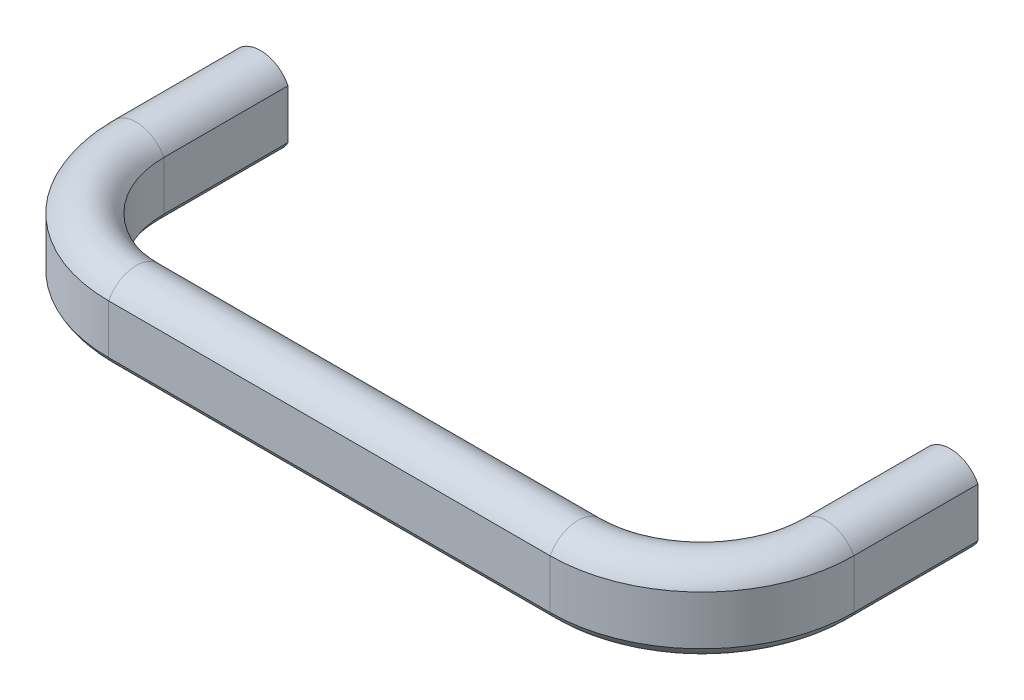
ISO-10303-21;
HEADER;
FILE_DESCRIPTION(('STEP AP214'),'2;1');
FILE_NAME('part.step','',(''),(''),'','','');
FILE_SCHEMA(('AUTOMOTIVE_DESIGN { 1 0 10303 214 1 1 1 1 }'));
ENDSEC;
DATA;
#1=APPLICATION_CONTEXT('core data for automotive mechanical design processes');
#2=APPLICATION_PROTOCOL_DEFINITION('international standard','automotive_design',2000,#1);
#3=PRODUCT_CONTEXT('',#1,'mechanical');
#4=PRODUCT('Part','Part','',(#3));
#5=PRODUCT_RELATED_PRODUCT_CATEGORY('part','',(#4));
#6=PRODUCT_DEFINITION_FORMATION('','',#4);
#7=PRODUCT_DEFINITION_CONTEXT('part definition',#1,'design');
#8=PRODUCT_DEFINITION('design','',#6,#7);
#9=PRODUCT_DEFINITION_SHAPE('','',#8);
#10=(LENGTH_UNIT() NAMED_UNIT(*) SI_UNIT(.MILLI.,.METRE.));
#11=(NAMED_UNIT(*) PLANE_ANGLE_UNIT() SI_UNIT($,.RADIAN.));
#12=(NAMED_UNIT(*) SI_UNIT($,.STERADIAN.) SOLID_ANGLE_UNIT());
#13=UNCERTAINTY_MEASURE_WITH_UNIT(LENGTH_MEASURE(1.E-05),#10,'distance_accuracy_value','');
#14=(GEOMETRIC_REPRESENTATION_CONTEXT(3) GLOBAL_UNCERTAINTY_ASSIGNED_CONTEXT((#13)) GLOBAL_UNIT_ASSIGNED_CONTEXT((#10,
#11,#12)) REPRESENTATION_CONTEXT('',''));
#15=CARTESIAN_POINT('',(0.,0.,0.));
#16=DIRECTION('',(0.,0.,1.));
#17=DIRECTION('',(1.,0.,0.));
#18=AXIS2_PLACEMENT_3D('',#15,#16,#17);
#19=CARTESIAN_POINT('',(0.,-1.5,0.));
#20=DIRECTION('',(0.,0.,1.));
#21=DIRECTION('',(0.,-1.,0.));
#22=AXIS2_PLACEMENT_3D('',#19,#20,#21);
#23=PLANE('',#22);
#24=CARTESIAN_POINT('',(0.,0.,0.));
#25=DIRECTION('',(0.,0.,1.));
#26=DIRECTION('',(1.,0.,0.));
#27=AXIS2_PLACEMENT_3D('',#24,#25,#26);
#28=CIRCLE('',#27,2.95);
#29=CARTESIAN_POINT('',(2.95,0.,0.));
#30=VERTEX_POINT('',#29);
#31=EDGE_CURVE('E9',#30,#30,#28,.T.);
#32=ORIENTED_EDGE('',*,*,#31,.T.);
#33=EDGE_LOOP('',(#32));
#34=FACE_BOUND('',#33,.T.);
#35=CARTESIAN_POINT('',(0.,-1.5,0.));
#36=DIRECTION('',(0.,0.,1.));
#37=DIRECTION('',(0.,-1.,0.));
#38=AXIS2_PLACEMENT_3D('',#35,#36,#37);
#39=CIRCLE('',#38,4.5);
#40=CARTESIAN_POINT('',(-4.,-3.56155281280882,0.));
#41=VERTEX_POINT('',#40);
#42=CARTESIAN_POINT('',(4.,-3.56155281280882,0.));
#43=VERTEX_POINT('',#42);
#44=EDGE_CURVE('E212',#41,#43,#39,.T.);
#45=ORIENTED_EDGE('',*,*,#44,.F.);
#46=DIRECTION('',(0.,1.,0.));
#47=VECTOR('',#46,1.);
#48=CARTESIAN_POINT('',(-4.,-3.56155281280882,0.));
#49=LINE('',#48,#47);
#50=CARTESIAN_POINT('',(-4.,3.56155281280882,0.));
#51=VERTEX_POINT('',#50);
#52=EDGE_CURVE('E29',#41,#51,#49,.T.);
#53=ORIENTED_EDGE('',*,*,#52,.T.);
#54=CARTESIAN_POINT('',(0.,1.5,0.));
#55=DIRECTION('',(0.,0.,-1.));
#56=DIRECTION('',(0.,1.,0.));
#57=AXIS2_PLACEMENT_3D('',#54,#55,#56);
#58=CIRCLE('',#57,4.5);
#59=CARTESIAN_POINT('',(4.,3.56155281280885,0.));
#60=VERTEX_POINT('',#59);
#61=EDGE_CURVE('E37',#51,#60,#58,.T.);
#62=ORIENTED_EDGE('',*,*,#61,.T.);
#63=DIRECTION('',(0.,1.,0.));
#64=VECTOR('',#63,1.);
#65=CARTESIAN_POINT('',(4.,-3.56155281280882,0.));
#66=LINE('',#65,#64);
#67=EDGE_CURVE('E235',#43,#60,#66,.T.);
#68=ORIENTED_EDGE('',*,*,#67,.F.);
#69=EDGE_LOOP('',(#45,#53,#62,#68));
#70=FACE_BOUND('',#69,.T.);
#71=ADVANCED_FACE('F14',(#34,#70),#23,.F.);
#72=CARTESIAN_POINT('',(100.,-1.5,0.));
#73=DIRECTION('',(0.,0.,-1.));
#74=DIRECTION('',(0.,-1.,0.));
#75=AXIS2_PLACEMENT_3D('',#72,#73,#74);
#76=PLANE('',#75);
#77=CARTESIAN_POINT('',(100.,0.,0.));
#78=DIRECTION('',(0.,0.,-1.));
#79=DIRECTION('',(-1.,0.,0.));
#80=AXIS2_PLACEMENT_3D('',#77,#78,#79);
#81=CIRCLE('',#80,2.95000000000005);
#82=CARTESIAN_POINT('',(97.05,0.,0.));
#83=VERTEX_POINT('',#82);
#84=EDGE_CURVE('E233',#83,#83,#81,.F.);
#85=ORIENTED_EDGE('',*,*,#84,.T.);
#86=EDGE_LOOP('',(#85));
#87=FACE_BOUND('',#86,.T.);
#88=CARTESIAN_POINT('',(100.,-1.5,0.));
#89=DIRECTION('',(0.,0.,-1.));
#90=DIRECTION('',(0.,-1.,0.));
#91=AXIS2_PLACEMENT_3D('',#88,#89,#90);
#92=CIRCLE('',#91,4.5);
#93=CARTESIAN_POINT('',(104.,-3.56155281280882,0.));
#94=VERTEX_POINT('',#93);
#95=CARTESIAN_POINT('',(96.,-3.56155281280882,0.));
#96=VERTEX_POINT('',#95);
#97=EDGE_CURVE('E109',#94,#96,#92,.T.);
#98=ORIENTED_EDGE('',*,*,#97,.T.);
#99=DIRECTION('',(0.,1.,0.));
#100=VECTOR('',#99,1.);
#101=CARTESIAN_POINT('',(96.,-3.56155281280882,0.));
#102=LINE('',#101,#100);
#103=CARTESIAN_POINT('',(96.,3.56155281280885,0.));
#104=VERTEX_POINT('',#103);
#105=EDGE_CURVE('E123',#96,#104,#102,.T.);
#106=ORIENTED_EDGE('',*,*,#105,.T.);
#107=CARTESIAN_POINT('',(100.,1.5,0.));
#108=DIRECTION('',(0.,0.,1.));
#109=DIRECTION('',(0.,1.,0.));
#110=AXIS2_PLACEMENT_3D('',#107,#108,#109);
#111=CIRCLE('',#110,4.5);
#112=CARTESIAN_POINT('',(104.,3.56155281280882,0.));
#113=VERTEX_POINT('',#112);
#114=EDGE_CURVE('E131',#113,#104,#111,.T.);
#115=ORIENTED_EDGE('',*,*,#114,.F.);
#116=DIRECTION('',(0.,1.,0.));
#117=VECTOR('',#116,1.);
#118=CARTESIAN_POINT('',(104.,-3.56155281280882,0.));
#119=LINE('',#118,#117);
#120=EDGE_CURVE('E126',#94,#113,#119,.T.);
#121=ORIENTED_EDGE('',*,*,#120,.F.);
#122=EDGE_LOOP('',(#98,#106,#115,#121));
#123=FACE_BOUND('',#122,.T.);
#124=ADVANCED_FACE('F121',(#87,#123),#76,.T.);
#125=CARTESIAN_POINT('',(-4.,-3.56155281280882,18.));
#126=DIRECTION('',(-1.,0.,0.));
#127=DIRECTION('',(0.,0.,1.));
#128=AXIS2_PLACEMENT_3D('',#125,#126,#127);
#129=PLANE('',#128);
#130=DIRECTION('',(0.,1.,0.));
#131=VECTOR('',#130,1.);
#132=CARTESIAN_POINT('',(-4.,-3.56155281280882,18.));
#133=LINE('',#132,#131);
#134=CARTESIAN_POINT('',(-4.,-3.56155281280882,18.));
#135=VERTEX_POINT('',#134);
#136=CARTESIAN_POINT('',(-4.,3.56155281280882,18.));
#137=VERTEX_POINT('',#136);
#138=EDGE_CURVE('E203',#135,#137,#133,.T.);
#139=ORIENTED_EDGE('',*,*,#138,.T.);
#140=DIRECTION('',(0.,0.,-1.));
#141=VECTOR('',#140,1.);
#142=CARTESIAN_POINT('',(-4.,3.56155281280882,18.));
#143=LINE('',#142,#141);
#144=EDGE_CURVE('E228',#137,#51,#143,.T.);
#145=ORIENTED_EDGE('',*,*,#144,.T.);
#146=ORIENTED_EDGE('',*,*,#52,.F.);
#147=DIRECTION('',(0.,0.,-1.));
#148=VECTOR('',#147,1.);
#149=CARTESIAN_POINT('',(-4.,-3.56155281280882,18.));
#150=LINE('',#149,#148);
#151=EDGE_CURVE('E230',#135,#41,#150,.T.);
#152=ORIENTED_EDGE('',*,*,#151,.F.);
#153=EDGE_LOOP('',(#139,#145,#146,#152));
#154=FACE_BOUND('',#153,.T.);
#155=ADVANCED_FACE('F266',(#154),#129,.T.);
#156=CARTESIAN_POINT('',(0.,1.5,18.));
#157=DIRECTION('',(0.,0.,-1.));
#158=DIRECTION('',(-1.,0.,0.));
#159=AXIS2_PLACEMENT_3D('',#156,#157,#158);
#160=CYLINDRICAL_SURFACE('',#159,4.5);
#161=CARTESIAN_POINT('',(0.,1.5,18.));
#162=DIRECTION('',(0.,0.,-1.));
#163=DIRECTION('',(0.,1.,0.));
#164=AXIS2_PLACEMENT_3D('',#161,#162,#163);
#165=CIRCLE('',#164,4.5);
#166=CARTESIAN_POINT('',(4.,3.56155281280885,18.));
#167=VERTEX_POINT('',#166);
#168=EDGE_CURVE('E218',#137,#167,#165,.T.);
#169=ORIENTED_EDGE('',*,*,#168,.T.);
#170=DIRECTION('',(0.,0.,-1.));
#171=VECTOR('',#170,1.);
#172=CARTESIAN_POINT('',(4.,3.56155281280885,18.));
#173=LINE('',#172,#171);
#174=EDGE_CURVE('E226',#167,#60,#173,.T.);
#175=ORIENTED_EDGE('',*,*,#174,.T.);
#176=ORIENTED_EDGE('',*,*,#61,.F.);
#177=ORIENTED_EDGE('',*,*,#144,.F.);
#178=EDGE_LOOP('',(#169,#175,#176,#177));
#179=FACE_BOUND('',#178,.T.);
#180=ADVANCED_FACE('F340',(#179),#160,.T.);
#181=CARTESIAN_POINT('',(4.,-3.56155281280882,18.));
#182=DIRECTION('',(-1.,0.,0.));
#183=DIRECTION('',(0.,-1.,0.));
#184=AXIS2_PLACEMENT_3D('',#181,#182,#183);
#185=PLANE('',#184);
#186=DIRECTION('',(0.,1.,0.));
#187=VECTOR('',#186,1.);
#188=CARTESIAN_POINT('',(4.,-3.56155281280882,18.));
#189=LINE('',#188,#187);
#190=CARTESIAN_POINT('',(4.,-3.56155281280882,18.));
#191=VERTEX_POINT('',#190);
#192=EDGE_CURVE('E215',#191,#167,#189,.T.);
#193=ORIENTED_EDGE('',*,*,#192,.F.);
#194=DIRECTION('',(0.,0.,-1.));
#195=VECTOR('',#194,1.);
#196=CARTESIAN_POINT('',(4.,-3.56155281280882,18.));
#197=LINE('',#196,#195);
#198=EDGE_CURVE('E223',#191,#43,#197,.T.);
#199=ORIENTED_EDGE('',*,*,#198,.T.);
#200=ORIENTED_EDGE('',*,*,#67,.T.);
#201=ORIENTED_EDGE('',*,*,#174,.F.);
#202=EDGE_LOOP('',(#193,#199,#200,#201));
#203=FACE_BOUND('',#202,.T.);
#204=ADVANCED_FACE('F336',(#203),#185,.F.);
#205=CARTESIAN_POINT('',(0.,-1.5,18.));
#206=DIRECTION('',(0.,0.,-1.));
#207=DIRECTION('',(-1.,0.,0.));
#208=AXIS2_PLACEMENT_3D('',#205,#206,#207);
#209=CYLINDRICAL_SURFACE('',#208,4.5);
#210=CARTESIAN_POINT('',(0.,-1.5,18.));
#211=DIRECTION('',(0.,0.,1.));
#212=DIRECTION('',(0.,-1.,0.));
#213=AXIS2_PLACEMENT_3D('',#210,#211,#212);
#214=CIRCLE('',#213,4.5);
#215=EDGE_CURVE('E188',#135,#191,#214,.T.);
#216=ORIENTED_EDGE('',*,*,#215,.F.);
#217=ORIENTED_EDGE('',*,*,#151,.T.);
#218=ORIENTED_EDGE('',*,*,#44,.T.);
#219=ORIENTED_EDGE('',*,*,#198,.F.);
#220=EDGE_LOOP('',(#216,#217,#218,#219));
#221=FACE_BOUND('',#220,.T.);
#222=ADVANCED_FACE('F332',(#221),#209,.T.);
#223=CARTESIAN_POINT('',(18.,0.,18.));
#224=DIRECTION('',(0.,-1.,0.));
#225=DIRECTION('',(1.,0.,0.));
#226=AXIS2_PLACEMENT_3D('',#223,#224,#225);
#227=CYLINDRICAL_SURFACE('',#226,22.);
#228=DIRECTION('',(0.,1.,0.));
#229=VECTOR('',#228,1.);
#230=CARTESIAN_POINT('',(18.,-3.56155281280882,40.));
#231=LINE('',#230,#229);
#232=CARTESIAN_POINT('',(18.,-3.56155281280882,40.));
#233=VERTEX_POINT('',#232);
#234=CARTESIAN_POINT('',(18.,3.56155281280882,40.));
#235=VERTEX_POINT('',#234);
#236=EDGE_CURVE('E179',#233,#235,#231,.T.);
#237=ORIENTED_EDGE('',*,*,#236,.T.);
#238=CARTESIAN_POINT('',(18.,3.56155281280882,18.));
#239=DIRECTION('',(0.,-1.,0.));
#240=DIRECTION('',(1.,0.,0.));
#241=AXIS2_PLACEMENT_3D('',#238,#239,#240);
#242=CIRCLE('',#241,22.);
#243=EDGE_CURVE('E206',#235,#137,#242,.T.);
#244=ORIENTED_EDGE('',*,*,#243,.T.);
#245=ORIENTED_EDGE('',*,*,#138,.F.);
#246=CARTESIAN_POINT('',(18.,-3.56155281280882,18.));
#247=DIRECTION('',(0.,-1.,0.));
#248=DIRECTION('',(1.,0.,0.));
#249=AXIS2_PLACEMENT_3D('',#246,#247,#248);
#250=CIRCLE('',#249,22.);
#251=EDGE_CURVE('E209',#233,#135,#250,.T.);
#252=ORIENTED_EDGE('',*,*,#251,.F.);
#253=EDGE_LOOP('',(#237,#244,#245,#252));
#254=FACE_BOUND('',#253,.T.);
#255=ADVANCED_FACE('F328',(#254),#227,.T.);
#256=CARTESIAN_POINT('',(18.,1.5,18.));
#257=DIRECTION('',(0.,-1.,0.));
#258=DIRECTION('',(1.,0.,0.));
#259=AXIS2_PLACEMENT_3D('',#256,#257,#258);
#260=TOROIDAL_SURFACE('',#259,18.,4.5);
#261=CARTESIAN_POINT('',(18.,1.5,36.));
#262=DIRECTION('',(-1.,0.,0.));
#263=DIRECTION('',(0.,1.,0.));
#264=AXIS2_PLACEMENT_3D('',#261,#262,#263);
#265=CIRCLE('',#264,4.5);
#266=CARTESIAN_POINT('',(18.,3.56155281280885,32.));
#267=VERTEX_POINT('',#266);
#268=EDGE_CURVE('E194',#235,#267,#265,.T.);
#269=ORIENTED_EDGE('',*,*,#268,.T.);
#270=CARTESIAN_POINT('',(18.,3.56155281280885,18.));
#271=DIRECTION('',(0.,-1.,0.));
#272=DIRECTION('',(1.,0.,0.));
#273=AXIS2_PLACEMENT_3D('',#270,#271,#272);
#274=CIRCLE('',#273,14.);
#275=EDGE_CURVE('E202',#267,#167,#274,.T.);
#276=ORIENTED_EDGE('',*,*,#275,.T.);
#277=ORIENTED_EDGE('',*,*,#168,.F.);
#278=ORIENTED_EDGE('',*,*,#243,.F.);
#279=EDGE_LOOP('',(#269,#276,#277,#278));
#280=FACE_BOUND('',#279,.T.);
#281=ADVANCED_FACE('F324',(#280),#260,.T.);
#282=CARTESIAN_POINT('',(18.,0.,18.));
#283=DIRECTION('',(0.,-1.,0.));
#284=DIRECTION('',(1.,0.,0.));
#285=AXIS2_PLACEMENT_3D('',#282,#283,#284);
#286=CYLINDRICAL_SURFACE('',#285,14.);
#287=DIRECTION('',(0.,1.,0.));
#288=VECTOR('',#287,1.);
#289=CARTESIAN_POINT('',(18.,-3.56155281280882,32.));
#290=LINE('',#289,#288);
#291=CARTESIAN_POINT('',(18.,-3.56155281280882,32.));
#292=VERTEX_POINT('',#291);
#293=EDGE_CURVE('E191',#292,#267,#290,.T.);
#294=ORIENTED_EDGE('',*,*,#293,.F.);
#295=CARTESIAN_POINT('',(18.,-3.56155281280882,18.));
#296=DIRECTION('',(0.,-1.,0.));
#297=DIRECTION('',(1.,0.,0.));
#298=AXIS2_PLACEMENT_3D('',#295,#296,#297);
#299=CIRCLE('',#298,14.);
#300=EDGE_CURVE('E199',#292,#191,#299,.T.);
#301=ORIENTED_EDGE('',*,*,#300,.T.);
#302=ORIENTED_EDGE('',*,*,#192,.T.);
#303=ORIENTED_EDGE('',*,*,#275,.F.);
#304=EDGE_LOOP('',(#294,#301,#302,#303));
#305=FACE_BOUND('',#304,.T.);
#306=ADVANCED_FACE('F320',(#305),#286,.F.);
#307=CARTESIAN_POINT('',(18.,-1.5,18.));
#308=DIRECTION('',(0.,-1.,0.));
#309=DIRECTION('',(1.,0.,0.));
#310=AXIS2_PLACEMENT_3D('',#307,#308,#309);
#311=TOROIDAL_SURFACE('',#310,18.,4.5);
#312=CARTESIAN_POINT('',(18.,-1.5,36.));
#313=DIRECTION('',(1.,0.,0.));
#314=DIRECTION('',(0.,-1.,0.));
#315=AXIS2_PLACEMENT_3D('',#312,#313,#314);
#316=CIRCLE('',#315,4.5);
#317=EDGE_CURVE('E164',#233,#292,#316,.T.);
#318=ORIENTED_EDGE('',*,*,#317,.F.);
#319=ORIENTED_EDGE('',*,*,#251,.T.);
#320=ORIENTED_EDGE('',*,*,#215,.T.);
#321=ORIENTED_EDGE('',*,*,#300,.F.);
#322=EDGE_LOOP('',(#318,#319,#320,#321));
#323=FACE_BOUND('',#322,.T.);
#324=ADVANCED_FACE('F316',(#323),#311,.T.);
#325=CARTESIAN_POINT('',(82.,-3.56155281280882,40.));
#326=DIRECTION('',(0.,0.,1.));
#327=DIRECTION('',(1.,0.,0.));
#328=AXIS2_PLACEMENT_3D('',#325,#326,#327);
#329=PLANE('',#328);
#330=DIRECTION('',(0.,1.,0.));
#331=VECTOR('',#330,1.);
#332=CARTESIAN_POINT('',(82.,-3.56155281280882,40.));
#333=LINE('',#332,#331);
#334=CARTESIAN_POINT('',(82.,-3.56155281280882,40.));
#335=VERTEX_POINT('',#334);
#336=CARTESIAN_POINT('',(82.,3.56155281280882,40.));
#337=VERTEX_POINT('',#336);
#338=EDGE_CURVE('E155',#335,#337,#333,.T.);
#339=ORIENTED_EDGE('',*,*,#338,.T.);
#340=DIRECTION('',(-1.,0.,0.));
#341=VECTOR('',#340,1.);
#342=CARTESIAN_POINT('',(82.,3.56155281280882,40.));
#343=LINE('',#342,#341);
#344=EDGE_CURVE('E182',#337,#235,#343,.T.);
#345=ORIENTED_EDGE('',*,*,#344,.T.);
#346=ORIENTED_EDGE('',*,*,#236,.F.);
#347=DIRECTION('',(-1.,0.,0.));
#348=VECTOR('',#347,1.);
#349=CARTESIAN_POINT('',(82.,-3.56155281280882,40.));
#350=LINE('',#349,#348);
#351=EDGE_CURVE('E185',#335,#233,#350,.T.);
#352=ORIENTED_EDGE('',*,*,#351,.F.);
#353=EDGE_LOOP('',(#339,#345,#346,#352));
#354=FACE_BOUND('',#353,.T.);
#355=ADVANCED_FACE('F312',(#354),#329,.T.);
#356=CARTESIAN_POINT('',(82.,1.5,36.));
#357=DIRECTION('',(-1.,0.,0.));
#358=DIRECTION('',(0.,0.,1.));
#359=AXIS2_PLACEMENT_3D('',#356,#357,#358);
#360=CYLINDRICAL_SURFACE('',#359,4.5);
#361=CARTESIAN_POINT('',(82.,1.5,36.));
#362=DIRECTION('',(-1.,0.,0.));
#363=DIRECTION('',(0.,1.,0.));
#364=AXIS2_PLACEMENT_3D('',#361,#362,#363);
#365=CIRCLE('',#364,4.5);
#366=CARTESIAN_POINT('',(82.,3.56155281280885,32.));
#367=VERTEX_POINT('',#366);
#368=EDGE_CURVE('E170',#337,#367,#365,.T.);
#369=ORIENTED_EDGE('',*,*,#368,.T.);
#370=DIRECTION('',(-1.,0.,0.));
#371=VECTOR('',#370,1.);
#372=CARTESIAN_POINT('',(82.,3.56155281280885,32.));
#373=LINE('',#372,#371);
#374=EDGE_CURVE('E178',#367,#267,#373,.T.);
#375=ORIENTED_EDGE('',*,*,#374,.T.);
#376=ORIENTED_EDGE('',*,*,#268,.F.);
#377=ORIENTED_EDGE('',*,*,#344,.F.);
#378=EDGE_LOOP('',(#369,#375,#376,#377));
#379=FACE_BOUND('',#378,.T.);
#380=ADVANCED_FACE('F308',(#379),#360,.T.);
#381=CARTESIAN_POINT('',(82.,-3.56155281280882,32.));
#382=DIRECTION('',(0.,0.,1.));
#383=DIRECTION('',(0.,1.,0.));
#384=AXIS2_PLACEMENT_3D('',#381,#382,#383);
#385=PLANE('',#384);
#386=DIRECTION('',(0.,1.,0.));
#387=VECTOR('',#386,1.);
#388=CARTESIAN_POINT('',(82.,-3.56155281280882,32.));
#389=LINE('',#388,#387);
#390=CARTESIAN_POINT('',(82.,-3.56155281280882,32.));
#391=VERTEX_POINT('',#390);
#392=EDGE_CURVE('E167',#391,#367,#389,.T.);
#393=ORIENTED_EDGE('',*,*,#392,.F.);
#394=DIRECTION('',(-1.,0.,0.));
#395=VECTOR('',#394,1.);
#396=CARTESIAN_POINT('',(82.,-3.56155281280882,32.));
#397=LINE('',#396,#395);
#398=EDGE_CURVE('E175',#391,#292,#397,.T.);
#399=ORIENTED_EDGE('',*,*,#398,.T.);
#400=ORIENTED_EDGE('',*,*,#293,.T.);
#401=ORIENTED_EDGE('',*,*,#374,.F.);
#402=EDGE_LOOP('',(#393,#399,#400,#401));
#403=FACE_BOUND('',#402,.T.);
#404=ADVANCED_FACE('F304',(#403),#385,.F.);
#405=CARTESIAN_POINT('',(82.,-1.5,36.));
#406=DIRECTION('',(-1.,0.,0.));
#407=DIRECTION('',(0.,0.,1.));
#408=AXIS2_PLACEMENT_3D('',#405,#406,#407);
#409=CYLINDRICAL_SURFACE('',#408,4.5);
#410=CARTESIAN_POINT('',(82.,-1.5,36.));
#411=DIRECTION('',(1.,0.,0.));
#412=DIRECTION('',(0.,-1.,0.));
#413=AXIS2_PLACEMENT_3D('',#410,#411,#412);
#414=CIRCLE('',#413,4.5);
#415=EDGE_CURVE('E150',#335,#391,#414,.T.);
#416=ORIENTED_EDGE('',*,*,#415,.F.);
#417=ORIENTED_EDGE('',*,*,#351,.T.);
#418=ORIENTED_EDGE('',*,*,#317,.T.);
#419=ORIENTED_EDGE('',*,*,#398,.F.);
#420=EDGE_LOOP('',(#416,#417,#418,#419));
#421=FACE_BOUND('',#420,.T.);
#422=ADVANCED_FACE('F300',(#421),#409,.T.);
#423=CARTESIAN_POINT('',(82.,0.,18.));
#424=DIRECTION('',(0.,-1.,0.));
#425=DIRECTION('',(1.,0.,0.));
#426=AXIS2_PLACEMENT_3D('',#423,#424,#425);
#427=CYLINDRICAL_SURFACE('',#426,22.);
#428=DIRECTION('',(0.,1.,0.));
#429=VECTOR('',#428,1.);
#430=CARTESIAN_POINT('',(104.,-3.56155281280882,18.));
#431=LINE('',#430,#429);
#432=CARTESIAN_POINT('',(104.,-3.56155281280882,18.));
#433=VERTEX_POINT('',#432);
#434=CARTESIAN_POINT('',(104.,3.56155281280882,18.));
#435=VERTEX_POINT('',#434);
#436=EDGE_CURVE('E117',#433,#435,#431,.T.);
#437=ORIENTED_EDGE('',*,*,#436,.T.);
#438=CARTESIAN_POINT('',(82.,3.56155281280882,18.));
#439=DIRECTION('',(0.,-1.,0.));
#440=DIRECTION('',(1.,0.,0.));
#441=AXIS2_PLACEMENT_3D('',#438,#439,#440);
#442=CIRCLE('',#441,22.);
#443=EDGE_CURVE('E158',#435,#337,#442,.T.);
#444=ORIENTED_EDGE('',*,*,#443,.T.);
#445=ORIENTED_EDGE('',*,*,#338,.F.);
#446=CARTESIAN_POINT('',(82.,-3.56155281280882,18.));
#447=DIRECTION('',(0.,-1.,0.));
#448=DIRECTION('',(1.,0.,0.));
#449=AXIS2_PLACEMENT_3D('',#446,#447,#448);
#450=CIRCLE('',#449,22.);
#451=EDGE_CURVE('E161',#433,#335,#450,.T.);
#452=ORIENTED_EDGE('',*,*,#451,.F.);
#453=EDGE_LOOP('',(#437,#444,#445,#452));
#454=FACE_BOUND('',#453,.T.);
#455=ADVANCED_FACE('F296',(#454),#427,.T.);
#456=CARTESIAN_POINT('',(82.,1.5,18.));
#457=DIRECTION('',(0.,-1.,0.));
#458=DIRECTION('',(1.,0.,0.));
#459=AXIS2_PLACEMENT_3D('',#456,#457,#458);
#460=TOROIDAL_SURFACE('',#459,18.,4.5);
#461=CARTESIAN_POINT('',(100.,1.5,18.));
#462=DIRECTION('',(0.,0.,1.));
#463=DIRECTION('',(0.,1.,0.));
#464=AXIS2_PLACEMENT_3D('',#461,#462,#463);
#465=CIRCLE('',#464,4.5);
#466=CARTESIAN_POINT('',(96.,3.56155281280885,18.));
#467=VERTEX_POINT('',#466);
#468=EDGE_CURVE('E140',#435,#467,#465,.T.);
#469=ORIENTED_EDGE('',*,*,#468,.T.);
#470=CARTESIAN_POINT('',(82.,3.56155281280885,18.));
#471=DIRECTION('',(0.,-1.,0.));
#472=DIRECTION('',(1.,0.,0.));
#473=AXIS2_PLACEMENT_3D('',#470,#471,#472);
#474=CIRCLE('',#473,14.);
#475=EDGE_CURVE('E154',#467,#367,#474,.T.);
#476=ORIENTED_EDGE('',*,*,#475,.T.);
#477=ORIENTED_EDGE('',*,*,#368,.F.);
#478=ORIENTED_EDGE('',*,*,#443,.F.);
#479=EDGE_LOOP('',(#469,#476,#477,#478));
#480=FACE_BOUND('',#479,.T.);
#481=ADVANCED_FACE('F292',(#480),#460,.T.);
#482=CARTESIAN_POINT('',(82.,0.,18.));
#483=DIRECTION('',(0.,-1.,0.));
#484=DIRECTION('',(1.,0.,0.));
#485=AXIS2_PLACEMENT_3D('',#482,#483,#484);
#486=CYLINDRICAL_SURFACE('',#485,14.);
#487=DIRECTION('',(0.,1.,0.));
#488=VECTOR('',#487,1.);
#489=CARTESIAN_POINT('',(96.,-3.56155281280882,18.));
#490=LINE('',#489,#488);
#491=CARTESIAN_POINT('',(96.,-3.56155281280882,18.));
#492=VERTEX_POINT('',#491);
#493=EDGE_CURVE('E138',#492,#467,#490,.T.);
#494=ORIENTED_EDGE('',*,*,#493,.F.);
#495=CARTESIAN_POINT('',(82.,-3.56155281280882,18.));
#496=DIRECTION('',(0.,-1.,0.));
#497=DIRECTION('',(1.,0.,0.));
#498=AXIS2_PLACEMENT_3D('',#495,#496,#497);
#499=CIRCLE('',#498,14.);
#500=EDGE_CURVE('E151',#492,#391,#499,.T.);
#501=ORIENTED_EDGE('',*,*,#500,.T.);
#502=ORIENTED_EDGE('',*,*,#392,.T.);
#503=ORIENTED_EDGE('',*,*,#475,.F.);
#504=EDGE_LOOP('',(#494,#501,#502,#503));
#505=FACE_BOUND('',#504,.T.);
#506=ADVANCED_FACE('F288',(#505),#486,.F.);
#507=CARTESIAN_POINT('',(82.,-1.5,18.));
#508=DIRECTION('',(0.,-1.,0.));
#509=DIRECTION('',(1.,0.,0.));
#510=AXIS2_PLACEMENT_3D('',#507,#508,#509);
#511=TOROIDAL_SURFACE('',#510,18.,4.5);
#512=CARTESIAN_POINT('',(100.,-1.5,18.));
#513=DIRECTION('',(0.,0.,-1.));
#514=DIRECTION('',(0.,-1.,0.));
#515=AXIS2_PLACEMENT_3D('',#512,#513,#514);
#516=CIRCLE('',#515,4.5);
#517=EDGE_CURVE('E112',#433,#492,#516,.T.);
#518=ORIENTED_EDGE('',*,*,#517,.F.);
#519=ORIENTED_EDGE('',*,*,#451,.T.);
#520=ORIENTED_EDGE('',*,*,#415,.T.);
#521=ORIENTED_EDGE('',*,*,#500,.F.);
#522=EDGE_LOOP('',(#518,#519,#520,#521));
#523=FACE_BOUND('',#522,.T.);
#524=ADVANCED_FACE('F275',(#523),#511,.T.);
#525=CARTESIAN_POINT('',(100.,-1.5,18.));
#526=DIRECTION('',(0.,0.,-1.));
#527=DIRECTION('',(0.,-1.,0.));
#528=AXIS2_PLACEMENT_3D('',#525,#526,#527);
#529=CYLINDRICAL_SURFACE('',#528,4.5);
#530=DIRECTION('',(0.,0.,-1.));
#531=VECTOR('',#530,1.);
#532=CARTESIAN_POINT('',(104.,-3.56155281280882,18.));
#533=LINE('',#532,#531);
#534=EDGE_CURVE('E148',#433,#94,#533,.T.);
#535=ORIENTED_EDGE('',*,*,#534,.F.);
#536=ORIENTED_EDGE('',*,*,#517,.T.);
#537=DIRECTION('',(0.,0.,-1.));
#538=VECTOR('',#537,1.);
#539=CARTESIAN_POINT('',(96.,-3.56155281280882,18.));
#540=LINE('',#539,#538);
#541=EDGE_CURVE('E105',#492,#96,#540,.T.);
#542=ORIENTED_EDGE('',*,*,#541,.T.);
#543=ORIENTED_EDGE('',*,*,#97,.F.);
#544=EDGE_LOOP('',(#535,#536,#542,#543));
#545=FACE_BOUND('',#544,.T.);
#546=ADVANCED_FACE('F108',(#545),#529,.T.);
#547=CARTESIAN_POINT('',(104.,-3.56155281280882,18.));
#548=DIRECTION('',(-1.,0.,0.));
#549=DIRECTION('',(0.,-1.,0.));
#550=AXIS2_PLACEMENT_3D('',#547,#548,#549);
#551=PLANE('',#550);
#552=DIRECTION('',(0.,0.,-1.));
#553=VECTOR('',#552,1.);
#554=CARTESIAN_POINT('',(104.,3.56155281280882,18.));
#555=LINE('',#554,#553);
#556=EDGE_CURVE('E146',#435,#113,#555,.T.);
#557=ORIENTED_EDGE('',*,*,#556,.F.);
#558=ORIENTED_EDGE('',*,*,#436,.F.);
#559=ORIENTED_EDGE('',*,*,#534,.T.);
#560=ORIENTED_EDGE('',*,*,#120,.T.);
#561=EDGE_LOOP('',(#557,#558,#559,#560));
#562=FACE_BOUND('',#561,.T.);
#563=ADVANCED_FACE('F274',(#562),#551,.F.);
#564=CARTESIAN_POINT('',(100.,1.5,18.));
#565=DIRECTION('',(0.,0.,-1.));
#566=DIRECTION('',(0.,-1.,0.));
#567=AXIS2_PLACEMENT_3D('',#564,#565,#566);
#568=CYLINDRICAL_SURFACE('',#567,4.5);
#569=DIRECTION('',(0.,0.,-1.));
#570=VECTOR('',#569,1.);
#571=CARTESIAN_POINT('',(96.,3.56155281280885,18.));
#572=LINE('',#571,#570);
#573=EDGE_CURVE('E116',#467,#104,#572,.T.);
#574=ORIENTED_EDGE('',*,*,#573,.F.);
#575=ORIENTED_EDGE('',*,*,#468,.F.);
#576=ORIENTED_EDGE('',*,*,#556,.T.);
#577=ORIENTED_EDGE('',*,*,#114,.T.);
#578=EDGE_LOOP('',(#574,#575,#576,#577));
#579=FACE_BOUND('',#578,.T.);
#580=ADVANCED_FACE('F279',(#579),#568,.T.);
#581=CARTESIAN_POINT('',(96.,-3.56155281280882,18.));
#582=DIRECTION('',(-1.,0.,0.));
#583=DIRECTION('',(0.,-1.,0.));
#584=AXIS2_PLACEMENT_3D('',#581,#582,#583);
#585=PLANE('',#584);
#586=ORIENTED_EDGE('',*,*,#493,.T.);
#587=ORIENTED_EDGE('',*,*,#573,.T.);
#588=ORIENTED_EDGE('',*,*,#105,.F.);
#589=ORIENTED_EDGE('',*,*,#541,.F.);
#590=EDGE_LOOP('',(#586,#587,#588,#589));
#591=FACE_BOUND('',#590,.T.);
#592=ADVANCED_FACE('F129',(#591),#585,.T.);
#593=CARTESIAN_POINT('',(102.5,0.,10.));
#594=DIRECTION('',(0.,0.,-1.));
#595=DIRECTION('',(0.,-1.,0.));
#596=AXIS2_PLACEMENT_3D('',#593,#594,#595);
#597=PLANE('',#596);
#598=CARTESIAN_POINT('',(100.,0.,10.));
#599=DIRECTION('',(0.,0.,1.));
#600=DIRECTION('',(0.,1.,0.));
#601=AXIS2_PLACEMENT_3D('',#598,#599,#600);
#602=CIRCLE('',#601,2.49999999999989);
#603=CARTESIAN_POINT('',(100.,2.49999999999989,10.));
#604=VERTEX_POINT('',#603);
#605=EDGE_CURVE('E127',#604,#604,#602,.T.);
#606=ORIENTED_EDGE('',*,*,#605,.F.);
#607=EDGE_LOOP('',(#606));
#608=FACE_BOUND('',#607,.T.);
#609=ADVANCED_FACE('F278',(#608),#597,.T.);
#610=CARTESIAN_POINT('',(100.,0.,20.9052735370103));
#611=DIRECTION('',(0.,0.,1.));
#612=DIRECTION('',(0.,1.,0.));
#613=AXIS2_PLACEMENT_3D('',#610,#611,#612);
#614=CYLINDRICAL_SURFACE('',#613,2.49999999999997);
#615=CARTESIAN_POINT('',(100.,0.,0.450000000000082));
#616=DIRECTION('',(0.,0.,-1.));
#617=DIRECTION('',(-1.,0.,0.));
#618=AXIS2_PLACEMENT_3D('',#615,#616,#617);
#619=CIRCLE('',#618,2.49999999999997);
#620=CARTESIAN_POINT('',(97.5,0.,0.450000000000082));
#621=VERTEX_POINT('',#620);
#622=EDGE_CURVE('E241',#621,#621,#619,.T.);
#623=ORIENTED_EDGE('',*,*,#622,.T.);
#624=EDGE_LOOP('',(#623));
#625=FACE_BOUND('',#624,.T.);
#626=ORIENTED_EDGE('',*,*,#605,.T.);
#627=EDGE_LOOP('',(#626));
#628=FACE_BOUND('',#627,.T.);
#629=ADVANCED_FACE('F473',(#625,#628),#614,.F.);
#630=CARTESIAN_POINT('',(-2.5,0.,10.));
#631=DIRECTION('',(0.,0.,-1.));
#632=DIRECTION('',(0.,-1.,0.));
#633=AXIS2_PLACEMENT_3D('',#630,#631,#632);
#634=PLANE('',#633);
#635=CARTESIAN_POINT('',(0.,0.,10.));
#636=DIRECTION('',(0.,0.,-1.));
#637=DIRECTION('',(0.,1.,0.));
#638=AXIS2_PLACEMENT_3D('',#635,#636,#637);
#639=CIRCLE('',#638,2.49999999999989);
#640=CARTESIAN_POINT('',(0.,2.49999999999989,10.));
#641=VERTEX_POINT('',#640);
#642=EDGE_CURVE('E545',#641,#641,#639,.T.);
#643=ORIENTED_EDGE('',*,*,#642,.T.);
#644=EDGE_LOOP('',(#643));
#645=FACE_BOUND('',#644,.T.);
#646=ADVANCED_FACE('F481',(#645),#634,.T.);
#647=CARTESIAN_POINT('',(0.,0.,20.9052735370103));
#648=DIRECTION('',(0.,0.,1.));
#649=DIRECTION('',(0.,1.,0.));
#650=AXIS2_PLACEMENT_3D('',#647,#648,#649);
#651=CYLINDRICAL_SURFACE('',#650,2.49999999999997);
#652=CARTESIAN_POINT('',(0.,0.,0.450000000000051));
#653=DIRECTION('',(0.,0.,1.));
#654=DIRECTION('',(1.,0.,0.));
#655=AXIS2_PLACEMENT_3D('',#652,#653,#654);
#656=CIRCLE('',#655,2.49999999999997);
#657=CARTESIAN_POINT('',(2.49999999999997,0.,0.450000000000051));
#658=VERTEX_POINT('',#657);
#659=EDGE_CURVE('E22',#658,#658,#656,.F.);
#660=ORIENTED_EDGE('',*,*,#659,.T.);
#661=EDGE_LOOP('',(#660));
#662=FACE_BOUND('',#661,.T.);
#663=ORIENTED_EDGE('',*,*,#642,.F.);
#664=EDGE_LOOP('',(#663));
#665=FACE_BOUND('',#664,.T.);
#666=ADVANCED_FACE('F246',(#662,#665),#651,.F.);
#667=CARTESIAN_POINT('',(100.,0.,0.));
#668=DIRECTION('',(0.,0.,-1.));
#669=DIRECTION('',(-1.,0.,0.));
#670=AXIS2_PLACEMENT_3D('',#667,#668,#669);
#671=CONICAL_SURFACE('',#670,2.95000000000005,0.785398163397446);
#672=ORIENTED_EDGE('',*,*,#622,.F.);
#673=EDGE_LOOP('',(#672));
#674=FACE_BOUND('',#673,.T.);
#675=ORIENTED_EDGE('',*,*,#84,.F.);
#676=EDGE_LOOP('',(#675));
#677=FACE_BOUND('',#676,.T.);
#678=ADVANCED_FACE('F250',(#674,#677),#671,.F.);
#679=CARTESIAN_POINT('',(0.,0.,0.450000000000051));
#680=DIRECTION('',(0.,0.,-1.));
#681=DIRECTION('',(-1.,0.,0.));
#682=AXIS2_PLACEMENT_3D('',#679,#680,#681);
#683=CONICAL_SURFACE('',#682,2.49999999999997,0.785398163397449);
#684=ORIENTED_EDGE('',*,*,#31,.F.);
#685=EDGE_LOOP('',(#684));
#686=FACE_BOUND('',#685,.T.);
#687=ORIENTED_EDGE('',*,*,#659,.F.);
#688=EDGE_LOOP('',(#687));
#689=FACE_BOUND('',#688,.T.);
#690=ADVANCED_FACE('F16',(#686,#689),#683,.F.);
#691=CLOSED_SHELL('',(#71,#124,#155,#180,#204,#222,#255,#281,#306,#324,#355,#380,#404,#422,#455,
#481,#506,#524,#546,#563,#580,#592,#609,#629,#646,#666,#678,#690));
#692=MANIFOLD_SOLID_BREP('B1',#691);
#693=ADVANCED_BREP_SHAPE_REPRESENTATION('',(#18,#692),#14);
#694=SHAPE_DEFINITION_REPRESENTATION(#9,#693);
ENDSEC;
END-ISO-10303-21;
